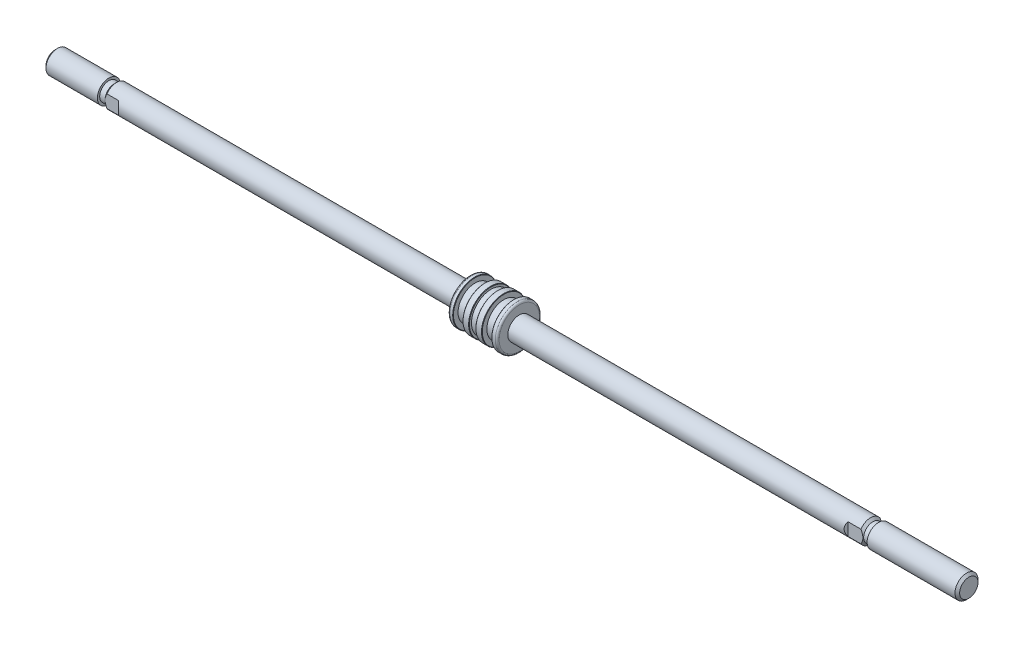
ISO-10303-21;
HEADER;
FILE_DESCRIPTION(('STEP AP214'),'2;1');
FILE_NAME('part.step','',(''),(''),'','','');
FILE_SCHEMA(('AUTOMOTIVE_DESIGN { 1 0 10303 214 1 1 1 1 }'));
ENDSEC;
DATA;
#1=APPLICATION_CONTEXT('core data for automotive mechanical design processes');
#2=APPLICATION_PROTOCOL_DEFINITION('international standard','automotive_design',2000,#1);
#3=PRODUCT_CONTEXT('',#1,'mechanical');
#4=PRODUCT('Part','Part','',(#3));
#5=PRODUCT_RELATED_PRODUCT_CATEGORY('part','',(#4));
#6=PRODUCT_DEFINITION_FORMATION('','',#4);
#7=PRODUCT_DEFINITION_CONTEXT('part definition',#1,'design');
#8=PRODUCT_DEFINITION('design','',#6,#7);
#9=PRODUCT_DEFINITION_SHAPE('','',#8);
#10=(LENGTH_UNIT() NAMED_UNIT(*) SI_UNIT(.MILLI.,.METRE.));
#11=(NAMED_UNIT(*) PLANE_ANGLE_UNIT() SI_UNIT($,.RADIAN.));
#12=(NAMED_UNIT(*) SI_UNIT($,.STERADIAN.) SOLID_ANGLE_UNIT());
#13=UNCERTAINTY_MEASURE_WITH_UNIT(LENGTH_MEASURE(1.E-05),#10,'distance_accuracy_value','');
#14=(GEOMETRIC_REPRESENTATION_CONTEXT(3) GLOBAL_UNCERTAINTY_ASSIGNED_CONTEXT((#13)) GLOBAL_UNIT_ASSIGNED_CONTEXT((#10,
#11,#12)) REPRESENTATION_CONTEXT('',''));
#15=CARTESIAN_POINT('',(0.,0.,0.));
#16=DIRECTION('',(0.,0.,1.));
#17=DIRECTION('',(1.,0.,0.));
#18=AXIS2_PLACEMENT_3D('',#15,#16,#17);
#19=CARTESIAN_POINT('',(-38.,0.,0.));
#20=DIRECTION('',(1.,0.,0.));
#21=DIRECTION('',(0.,0.,-1.));
#22=AXIS2_PLACEMENT_3D('',#19,#20,#21);
#23=PLANE('',#22);
#24=CARTESIAN_POINT('',(-38.0000000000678,0.,0.));
#25=DIRECTION('',(1.,0.,0.));
#26=DIRECTION('',(0.,0.,-1.));
#27=AXIS2_PLACEMENT_3D('',#24,#25,#26);
#28=CIRCLE('',#27,2.38650000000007);
#29=CARTESIAN_POINT('',(-38.0000000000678,0.,-2.38650000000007));
#30=VERTEX_POINT('',#29);
#31=EDGE_CURVE('E141',#30,#30,#28,.T.);
#32=ORIENTED_EDGE('',*,*,#31,.F.);
#33=EDGE_LOOP('',(#32));
#34=FACE_BOUND('',#33,.T.);
#35=ADVANCED_FACE('F17',(#34),#23,.F.);
#36=CARTESIAN_POINT('',(-37.3865000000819,0.,0.));
#37=DIRECTION('',(1.,0.,0.));
#38=DIRECTION('',(0.,0.,-1.));
#39=AXIS2_PLACEMENT_3D('',#36,#37,#38);
#40=CONICAL_SURFACE('',#39,2.9999999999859,0.785398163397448);
#41=CARTESIAN_POINT('',(-37.3865,0.,0.));
#42=DIRECTION('',(-1.,0.,0.));
#43=DIRECTION('',(0.,0.,1.));
#44=AXIS2_PLACEMENT_3D('',#41,#42,#43);
#45=CIRCLE('',#44,3.);
#46=CARTESIAN_POINT('',(-37.3865,0.,3.));
#47=VERTEX_POINT('',#46);
#48=EDGE_CURVE('E137',#47,#47,#45,.F.);
#49=ORIENTED_EDGE('',*,*,#48,.F.);
#50=EDGE_LOOP('',(#49));
#51=FACE_BOUND('',#50,.T.);
#52=ORIENTED_EDGE('',*,*,#31,.T.);
#53=EDGE_LOOP('',(#52));
#54=FACE_BOUND('',#53,.T.);
#55=ADVANCED_FACE('F334',(#51,#54),#40,.T.);
#56=CARTESIAN_POINT('',(82.9,0.,0.));
#57=DIRECTION('',(-1.,0.,0.));
#58=DIRECTION('',(0.,0.,1.));
#59=AXIS2_PLACEMENT_3D('',#56,#57,#58);
#60=CYLINDRICAL_SURFACE('',#59,3.);
#61=ORIENTED_EDGE('',*,*,#48,.T.);
#62=EDGE_LOOP('',(#61));
#63=FACE_BOUND('',#62,.T.);
#64=CARTESIAN_POINT('',(-24.,0.,0.));
#65=DIRECTION('',(-1.,0.,0.));
#66=DIRECTION('',(0.,0.,1.));
#67=AXIS2_PLACEMENT_3D('',#64,#65,#66);
#68=CIRCLE('',#67,3.);
#69=CARTESIAN_POINT('',(-24.,0.,3.));
#70=VERTEX_POINT('',#69);
#71=EDGE_CURVE('E140',#70,#70,#68,.T.);
#72=ORIENTED_EDGE('',*,*,#71,.T.);
#73=EDGE_LOOP('',(#72));
#74=FACE_BOUND('',#73,.T.);
#75=ADVANCED_FACE('F341',(#63,#74),#60,.T.);
#76=CARTESIAN_POINT('',(-24.,3.,0.));
#77=DIRECTION('',(-1.,0.,0.));
#78=DIRECTION('',(0.,0.,1.));
#79=AXIS2_PLACEMENT_3D('',#76,#77,#78);
#80=PLANE('',#79);
#81=CARTESIAN_POINT('',(-24.,0.,0.));
#82=DIRECTION('',(-1.,0.,0.));
#83=DIRECTION('',(0.,0.,1.));
#84=AXIS2_PLACEMENT_3D('',#81,#82,#83);
#85=CIRCLE('',#84,2.4);
#86=CARTESIAN_POINT('',(-24.,0.,2.4));
#87=VERTEX_POINT('',#86);
#88=EDGE_CURVE('E129',#87,#87,#85,.F.);
#89=ORIENTED_EDGE('',*,*,#88,.F.);
#90=EDGE_LOOP('',(#89));
#91=FACE_BOUND('',#90,.T.);
#92=ORIENTED_EDGE('',*,*,#71,.F.);
#93=EDGE_LOOP('',(#92));
#94=FACE_BOUND('',#93,.T.);
#95=ADVANCED_FACE('F470',(#91,#94),#80,.F.);
#96=CARTESIAN_POINT('',(82.9,0.,0.));
#97=DIRECTION('',(-1.,0.,0.));
#98=DIRECTION('',(0.,0.,1.));
#99=AXIS2_PLACEMENT_3D('',#96,#97,#98);
#100=CYLINDRICAL_SURFACE('',#99,2.4);
#101=ORIENTED_EDGE('',*,*,#88,.T.);
#102=EDGE_LOOP('',(#101));
#103=FACE_BOUND('',#102,.T.);
#104=CARTESIAN_POINT('',(-22.5999999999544,0.,0.));
#105=DIRECTION('',(1.,0.,0.));
#106=DIRECTION('',(0.,0.,-1.));
#107=AXIS2_PLACEMENT_3D('',#104,#105,#106);
#108=CIRCLE('',#107,2.40000000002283);
#109=CARTESIAN_POINT('',(-22.5999999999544,0.,-2.40000000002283));
#110=VERTEX_POINT('',#109);
#111=EDGE_CURVE('E98',#110,#110,#108,.T.);
#112=ORIENTED_EDGE('',*,*,#111,.F.);
#113=EDGE_LOOP('',(#112));
#114=FACE_BOUND('',#113,.T.);
#115=ADVANCED_FACE('F464',(#103,#114),#100,.T.);
#116=CARTESIAN_POINT('',(-22.46,-6.,-5.));
#117=DIRECTION('',(-1.,0.,0.));
#118=DIRECTION('',(0.,0.,1.));
#119=AXIS2_PLACEMENT_3D('',#116,#117,#118);
#120=PLANE('',#119);
#121=DIRECTION('',(0.,1.,0.));
#122=VECTOR('',#121,1.);
#123=CARTESIAN_POINT('',(-22.46,-6.,-2.5));
#124=LINE('',#123,#122);
#125=CARTESIAN_POINT('',(-22.4599999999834,0.448998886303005,-2.5));
#126=VERTEX_POINT('',#125);
#127=CARTESIAN_POINT('',(-22.4599999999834,-0.448998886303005,-2.5));
#128=VERTEX_POINT('',#127);
#129=EDGE_CURVE('E125',#126,#128,#124,.F.);
#130=ORIENTED_EDGE('',*,*,#129,.T.);
#131=CARTESIAN_POINT('',(-22.4599999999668,0.,0.));
#132=DIRECTION('',(1.,0.,0.));
#133=DIRECTION('',(0.,0.,-1.));
#134=AXIS2_PLACEMENT_3D('',#131,#132,#133);
#135=CIRCLE('',#134,2.53999999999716);
#136=EDGE_CURVE('E109',#126,#128,#135,.F.);
#137=ORIENTED_EDGE('',*,*,#136,.F.);
#138=EDGE_LOOP('',(#130,#137));
#139=FACE_BOUND('',#138,.T.);
#140=ADVANCED_FACE('F462',(#139),#120,.F.);
#141=CARTESIAN_POINT('',(-22.46,-6.,2.5));
#142=DIRECTION('',(-1.,0.,0.));
#143=DIRECTION('',(0.,0.,1.));
#144=AXIS2_PLACEMENT_3D('',#141,#142,#143);
#145=PLANE('',#144);
#146=CARTESIAN_POINT('',(-22.4599999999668,0.,0.));
#147=DIRECTION('',(1.,0.,0.));
#148=DIRECTION('',(0.,0.,-1.));
#149=AXIS2_PLACEMENT_3D('',#146,#147,#148);
#150=CIRCLE('',#149,2.53999999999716);
#151=CARTESIAN_POINT('',(-22.4599999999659,-0.448998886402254,2.5));
#152=VERTEX_POINT('',#151);
#153=CARTESIAN_POINT('',(-22.4599999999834,0.448998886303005,2.5));
#154=VERTEX_POINT('',#153);
#155=EDGE_CURVE('E90',#152,#154,#150,.F.);
#156=ORIENTED_EDGE('',*,*,#155,.F.);
#157=DIRECTION('',(0.,1.,0.));
#158=VECTOR('',#157,1.);
#159=CARTESIAN_POINT('',(-22.46,-6.,2.5));
#160=LINE('',#159,#158);
#161=EDGE_CURVE('E94',#152,#154,#160,.T.);
#162=ORIENTED_EDGE('',*,*,#161,.T.);
#163=EDGE_LOOP('',(#156,#162));
#164=FACE_BOUND('',#163,.T.);
#165=ADVANCED_FACE('F92',(#164),#145,.F.);
#166=CARTESIAN_POINT('',(-19.,-6.,-2.5));
#167=DIRECTION('',(0.70710678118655,0.,0.707106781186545));
#168=DIRECTION('',(0.707106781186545,0.,-0.70710678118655));
#169=AXIS2_PLACEMENT_3D('',#166,#167,#168);
#170=PLANE('',#169);
#171=CARTESIAN_POINT('',(-21.5,0.,0.));
#172=DIRECTION('',(0.70710678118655,0.,0.707106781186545));
#173=DIRECTION('',(-0.707106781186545,0.,0.70710678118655));
#174=AXIS2_PLACEMENT_3D('',#171,#172,#173);
#175=ELLIPSE('',#174,4.24264068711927,3.);
#176=CARTESIAN_POINT('',(-19.,-1.6583123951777,-2.5));
#177=VERTEX_POINT('',#176);
#178=CARTESIAN_POINT('',(-19.,1.6583123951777,-2.5));
#179=VERTEX_POINT('',#178);
#180=EDGE_CURVE('E437',#177,#179,#175,.T.);
#181=ORIENTED_EDGE('',*,*,#180,.F.);
#182=DIRECTION('',(0.,1.,0.));
#183=VECTOR('',#182,1.);
#184=CARTESIAN_POINT('',(-19.,-6.,-2.5));
#185=LINE('',#184,#183);
#186=EDGE_CURVE('E130',#177,#179,#185,.T.);
#187=ORIENTED_EDGE('',*,*,#186,.T.);
#188=EDGE_LOOP('',(#181,#187));
#189=FACE_BOUND('',#188,.T.);
#190=ADVANCED_FACE('F320',(#189),#170,.F.);
#191=CARTESIAN_POINT('',(-22.46,-6.,-2.5));
#192=DIRECTION('',(0.,0.,1.));
#193=DIRECTION('',(1.,0.,0.));
#194=AXIS2_PLACEMENT_3D('',#191,#192,#193);
#195=PLANE('',#194);
#196=ORIENTED_EDGE('',*,*,#186,.F.);
#197=DIRECTION('',(-1.,0.,0.));
#198=VECTOR('',#197,1.);
#199=CARTESIAN_POINT('',(82.9,-1.6583123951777,-2.5));
#200=LINE('',#199,#198);
#201=CARTESIAN_POINT('',(-21.9999999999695,-1.65831239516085,-2.5));
#202=VERTEX_POINT('',#201);
#203=EDGE_CURVE('E133',#202,#177,#200,.F.);
#204=ORIENTED_EDGE('',*,*,#203,.F.);
#205=CARTESIAN_POINT('',(-22.4599999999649,-0.448998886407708,-2.5));
#206=CARTESIAN_POINT('',(-22.4436019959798,-0.541923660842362,-2.5));
#207=CARTESIAN_POINT('',(-22.422379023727,-0.633854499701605,-2.5));
#208=CARTESIAN_POINT('',(-22.3718615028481,-0.815259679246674,-2.5));
#209=CARTESIAN_POINT('',(-22.3425860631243,-0.904739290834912,-2.5));
#210=CARTESIAN_POINT('',(-22.2777433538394,-1.08041958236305,-2.5));
#211=CARTESIAN_POINT('',(-22.2422350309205,-1.16664251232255,-2.5));
#212=CARTESIAN_POINT('',(-22.1660562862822,-1.3367963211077,-2.5));
#213=CARTESIAN_POINT('',(-22.1253841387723,-1.42072642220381,-2.5));
#214=CARTESIAN_POINT('',(-22.0692905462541,-1.52955928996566,-2.5));
#215=CARTESIAN_POINT('',(-22.0557042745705,-1.55542639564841,-2.5));
#216=CARTESIAN_POINT('',(-22.0281373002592,-1.60699838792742,-2.5));
#217=CARTESIAN_POINT('',(-22.0141560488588,-1.6327029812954,-2.5));
#218=CARTESIAN_POINT('',(-21.9999999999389,-1.65831239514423,-2.5));
#219=B_SPLINE_CURVE_WITH_KNOTS('',3,(#205,#206,#207,#208,#209,#210,#211,#212,#213,#214,#215,
#216,#217,#218),.UNSPECIFIED.,.F.,.F.,(4,2,2,2,2,2,4),(0.,0.282752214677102,0.564839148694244,
0.844389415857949,1.12403335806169,1.21168601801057,1.29946711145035),.UNSPECIFIED.);
#220=EDGE_CURVE('E128',#128,#202,#219,.T.);
#221=ORIENTED_EDGE('',*,*,#220,.F.);
#222=ORIENTED_EDGE('',*,*,#129,.F.);
#223=CARTESIAN_POINT('',(-21.9999999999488,1.65831239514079,-2.50000000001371));
#224=CARTESIAN_POINT('',(-22.0262525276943,1.6108142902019,-2.50000000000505));
#225=CARTESIAN_POINT('',(-22.0519105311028,1.56298651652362,-2.50000000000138));
#226=CARTESIAN_POINT('',(-22.1018578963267,1.46660480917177,-2.49999999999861));
#227=CARTESIAN_POINT('',(-22.1261468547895,1.4180506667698,-2.49999999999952));
#228=CARTESIAN_POINT('',(-22.1963411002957,1.27192090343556,-2.50000000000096));
#229=CARTESIAN_POINT('',(-22.2399439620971,1.17321868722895,-2.50000000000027));
#230=CARTESIAN_POINT('',(-22.3191456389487,0.972359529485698,-2.49999999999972));
#231=CARTESIAN_POINT('',(-22.3547293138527,0.870196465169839,-2.49999999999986));
#232=CARTESIAN_POINT('',(-22.4157271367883,0.662163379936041,-2.50000000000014));
#233=CARTESIAN_POINT('',(-22.4410708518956,0.556272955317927,-2.50000000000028));
#234=CARTESIAN_POINT('',(-22.459999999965,0.448998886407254,-2.5));
#235=B_SPLINE_CURVE_WITH_KNOTS('',3,(#223,#224,#225,#226,#227,#228,#229,#230,#231,#232,#233,
#234),.UNSPECIFIED.,.F.,.F.,(4,2,2,2,2,4),(0.,0.162805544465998,0.325658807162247,
0.64910085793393,0.973148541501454,1.29938863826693),.UNSPECIFIED.);
#236=CARTESIAN_POINT('',(-21.9999999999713,1.65831239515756,-2.5));
#237=VERTEX_POINT('',#236);
#238=EDGE_CURVE('E97',#237,#126,#235,.T.);
#239=ORIENTED_EDGE('',*,*,#238,.F.);
#240=DIRECTION('',(-1.,0.,0.));
#241=VECTOR('',#240,1.);
#242=CARTESIAN_POINT('',(82.9,1.6583123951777,-2.5));
#243=LINE('',#242,#241);
#244=EDGE_CURVE('E124',#179,#237,#243,.T.);
#245=ORIENTED_EDGE('',*,*,#244,.F.);
#246=EDGE_LOOP('',(#196,#204,#221,#222,#239,#245));
#247=FACE_BOUND('',#246,.T.);
#248=ADVANCED_FACE('F316',(#247),#195,.F.);
#249=CARTESIAN_POINT('',(-21.9999999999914,0.,0.));
#250=DIRECTION('',(1.,0.,0.));
#251=DIRECTION('',(0.,0.,-1.));
#252=AXIS2_PLACEMENT_3D('',#249,#250,#251);
#253=CONICAL_SURFACE('',#252,2.99999999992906,0.785398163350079);
#254=CARTESIAN_POINT('',(-21.9999999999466,-1.65831239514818,2.50000000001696));
#255=CARTESIAN_POINT('',(-22.0262525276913,-1.61081429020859,2.50000000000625));
#256=CARTESIAN_POINT('',(-22.0519105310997,-1.56298651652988,2.50000000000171));
#257=CARTESIAN_POINT('',(-22.1018578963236,-1.46660480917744,2.49999999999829));
#258=CARTESIAN_POINT('',(-22.1261468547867,-1.41805066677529,2.4999999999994));
#259=CARTESIAN_POINT('',(-22.1963411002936,-1.27192090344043,2.50000000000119));
#260=CARTESIAN_POINT('',(-22.2399439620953,-1.17321868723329,2.50000000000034));
#261=CARTESIAN_POINT('',(-22.3191456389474,-0.972359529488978,2.49999999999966));
#262=CARTESIAN_POINT('',(-22.3547293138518,-0.870196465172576,2.49999999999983));
#263=CARTESIAN_POINT('',(-22.415727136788,-0.662163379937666,2.50000000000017));
#264=CARTESIAN_POINT('',(-22.4410708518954,-0.556272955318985,2.50000000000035));
#265=CARTESIAN_POINT('',(-22.4599999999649,-0.448998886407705,2.5));
#266=B_SPLINE_CURVE_WITH_KNOTS('',3,(#254,#255,#256,#257,#258,#259,#260,#261,#262,#263,#264,
#265),.UNSPECIFIED.,.F.,.F.,(4,2,2,2,2,4),(0.,0.162805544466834,0.325658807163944,
0.649100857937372,0.973148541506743,1.29938863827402),.UNSPECIFIED.);
#267=CARTESIAN_POINT('',(-21.9999999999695,-1.65831239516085,2.5));
#268=VERTEX_POINT('',#267);
#269=EDGE_CURVE('E101',#268,#152,#266,.T.);
#270=ORIENTED_EDGE('',*,*,#269,.T.);
#271=ORIENTED_EDGE('',*,*,#155,.T.);
#272=CARTESIAN_POINT('',(-22.4599999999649,0.448998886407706,2.5));
#273=CARTESIAN_POINT('',(-22.4436019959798,0.541923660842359,2.5));
#274=CARTESIAN_POINT('',(-22.422379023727,0.633854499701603,2.5));
#275=CARTESIAN_POINT('',(-22.3718615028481,0.815259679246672,2.5));
#276=CARTESIAN_POINT('',(-22.3425860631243,0.904739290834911,2.5));
#277=CARTESIAN_POINT('',(-22.2777433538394,1.08041958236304,2.5));
#278=CARTESIAN_POINT('',(-22.2422350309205,1.16664251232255,2.5));
#279=CARTESIAN_POINT('',(-22.1660562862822,1.3367963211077,2.5));
#280=CARTESIAN_POINT('',(-22.1253841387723,1.42072642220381,2.5));
#281=CARTESIAN_POINT('',(-22.0692905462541,1.52955928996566,2.5));
#282=CARTESIAN_POINT('',(-22.0557042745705,1.55542639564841,2.5));
#283=CARTESIAN_POINT('',(-22.0281373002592,1.60699838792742,2.5));
#284=CARTESIAN_POINT('',(-22.0141560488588,1.6327029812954,2.5));
#285=CARTESIAN_POINT('',(-21.9999999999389,1.65831239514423,2.5));
#286=B_SPLINE_CURVE_WITH_KNOTS('',3,(#272,#273,#274,#275,#276,#277,#278,#279,#280,#281,#282,
#283,#284,#285),.UNSPECIFIED.,.F.,.F.,(4,2,2,2,2,2,4),(0.,0.282752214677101,0.564839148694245,
0.844389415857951,1.12403335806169,1.21168601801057,1.29946711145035),.UNSPECIFIED.);
#287=CARTESIAN_POINT('',(-21.9999999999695,1.65831239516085,2.5));
#288=VERTEX_POINT('',#287);
#289=EDGE_CURVE('E113',#154,#288,#286,.T.);
#290=ORIENTED_EDGE('',*,*,#289,.T.);
#291=CARTESIAN_POINT('',(-22.,0.,0.));
#292=DIRECTION('',(-1.,0.,0.));
#293=DIRECTION('',(0.,0.,1.));
#294=AXIS2_PLACEMENT_3D('',#291,#292,#293);
#295=CIRCLE('',#294,3.);
#296=EDGE_CURVE('E120',#237,#288,#295,.F.);
#297=ORIENTED_EDGE('',*,*,#296,.F.);
#298=ORIENTED_EDGE('',*,*,#238,.T.);
#299=ORIENTED_EDGE('',*,*,#136,.T.);
#300=ORIENTED_EDGE('',*,*,#220,.T.);
#301=CARTESIAN_POINT('',(-22.,0.,0.));
#302=DIRECTION('',(-1.,0.,0.));
#303=DIRECTION('',(0.,0.,1.));
#304=AXIS2_PLACEMENT_3D('',#301,#302,#303);
#305=CIRCLE('',#304,3.);
#306=EDGE_CURVE('E105',#268,#202,#305,.F.);
#307=ORIENTED_EDGE('',*,*,#306,.F.);
#308=EDGE_LOOP('',(#270,#271,#290,#297,#298,#299,#300,#307));
#309=FACE_BOUND('',#308,.T.);
#310=ORIENTED_EDGE('',*,*,#111,.T.);
#311=EDGE_LOOP('',(#310));
#312=FACE_BOUND('',#311,.T.);
#313=ADVANCED_FACE('F102',(#309,#312),#253,.T.);
#314=CARTESIAN_POINT('',(-19.,-6.,2.5));
#315=DIRECTION('',(0.,0.,-1.));
#316=DIRECTION('',(-1.,0.,0.));
#317=AXIS2_PLACEMENT_3D('',#314,#315,#316);
#318=PLANE('',#317);
#319=DIRECTION('',(0.,1.,0.));
#320=VECTOR('',#319,1.);
#321=CARTESIAN_POINT('',(-19.,-6.,2.5));
#322=LINE('',#321,#320);
#323=CARTESIAN_POINT('',(-19.,-1.6583123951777,2.5));
#324=VERTEX_POINT('',#323);
#325=CARTESIAN_POINT('',(-19.,1.6583123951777,2.5));
#326=VERTEX_POINT('',#325);
#327=EDGE_CURVE('E115',#324,#326,#322,.T.);
#328=ORIENTED_EDGE('',*,*,#327,.T.);
#329=DIRECTION('',(-1.,0.,0.));
#330=VECTOR('',#329,1.);
#331=CARTESIAN_POINT('',(82.9,1.6583123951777,2.5));
#332=LINE('',#331,#330);
#333=EDGE_CURVE('E123',#288,#326,#332,.F.);
#334=ORIENTED_EDGE('',*,*,#333,.F.);
#335=ORIENTED_EDGE('',*,*,#289,.F.);
#336=ORIENTED_EDGE('',*,*,#161,.F.);
#337=ORIENTED_EDGE('',*,*,#269,.F.);
#338=DIRECTION('',(-1.,0.,0.));
#339=VECTOR('',#338,1.);
#340=CARTESIAN_POINT('',(82.9,-1.6583123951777,2.5));
#341=LINE('',#340,#339);
#342=EDGE_CURVE('E134',#324,#268,#341,.T.);
#343=ORIENTED_EDGE('',*,*,#342,.F.);
#344=EDGE_LOOP('',(#328,#334,#335,#336,#337,#343));
#345=FACE_BOUND('',#344,.T.);
#346=ADVANCED_FACE('F111',(#345),#318,.F.);
#347=CARTESIAN_POINT('',(-16.5,-6.,5.));
#348=DIRECTION('',(0.707106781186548,0.,-0.707106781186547));
#349=DIRECTION('',(-0.707106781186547,0.,-0.707106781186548));
#350=AXIS2_PLACEMENT_3D('',#347,#348,#349);
#351=PLANE('',#350);
#352=ORIENTED_EDGE('',*,*,#327,.F.);
#353=CARTESIAN_POINT('',(-21.5,0.,0.));
#354=DIRECTION('',(0.707106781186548,0.,-0.707106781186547));
#355=DIRECTION('',(-0.707106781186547,0.,-0.707106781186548));
#356=AXIS2_PLACEMENT_3D('',#353,#354,#355);
#357=ELLIPSE('',#356,4.24264068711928,3.);
#358=EDGE_CURVE('E436',#326,#324,#357,.T.);
#359=ORIENTED_EDGE('',*,*,#358,.F.);
#360=EDGE_LOOP('',(#352,#359));
#361=FACE_BOUND('',#360,.T.);
#362=ADVANCED_FACE('F290',(#361),#351,.F.);
#363=CARTESIAN_POINT('',(82.9,0.,0.));
#364=DIRECTION('',(-1.,0.,0.));
#365=DIRECTION('',(0.,0.,1.));
#366=AXIS2_PLACEMENT_3D('',#363,#364,#365);
#367=CYLINDRICAL_SURFACE('',#366,3.);
#368=ORIENTED_EDGE('',*,*,#203,.T.);
#369=ORIENTED_EDGE('',*,*,#180,.T.);
#370=ORIENTED_EDGE('',*,*,#244,.T.);
#371=ORIENTED_EDGE('',*,*,#296,.T.);
#372=ORIENTED_EDGE('',*,*,#333,.T.);
#373=ORIENTED_EDGE('',*,*,#358,.T.);
#374=ORIENTED_EDGE('',*,*,#342,.T.);
#375=ORIENTED_EDGE('',*,*,#306,.T.);
#376=EDGE_LOOP('',(#368,#369,#370,#371,#372,#373,#374,#375));
#377=FACE_BOUND('',#376,.T.);
#378=CARTESIAN_POINT('',(68.6,0.,0.));
#379=DIRECTION('',(-1.,0.,0.));
#380=DIRECTION('',(0.,0.,1.));
#381=AXIS2_PLACEMENT_3D('',#378,#379,#380);
#382=CIRCLE('',#381,3.);
#383=CARTESIAN_POINT('',(68.6,0.,3.));
#384=VERTEX_POINT('',#383);
#385=EDGE_CURVE('E433',#384,#384,#382,.T.);
#386=ORIENTED_EDGE('',*,*,#385,.T.);
#387=EDGE_LOOP('',(#386));
#388=FACE_BOUND('',#387,.T.);
#389=ADVANCED_FACE('F286',(#377,#388),#367,.T.);
#390=CARTESIAN_POINT('',(68.6,3.,0.));
#391=DIRECTION('',(-1.,0.,0.));
#392=DIRECTION('',(0.,0.,1.));
#393=AXIS2_PLACEMENT_3D('',#390,#391,#392);
#394=PLANE('',#393);
#395=CARTESIAN_POINT('',(68.6,0.,0.));
#396=DIRECTION('',(-1.,0.,0.));
#397=DIRECTION('',(0.,0.,1.));
#398=AXIS2_PLACEMENT_3D('',#395,#396,#397);
#399=CIRCLE('',#398,2.95);
#400=CARTESIAN_POINT('',(68.6,0.,2.95));
#401=VERTEX_POINT('',#400);
#402=EDGE_CURVE('E430',#401,#401,#399,.F.);
#403=ORIENTED_EDGE('',*,*,#402,.F.);
#404=EDGE_LOOP('',(#403));
#405=FACE_BOUND('',#404,.T.);
#406=ORIENTED_EDGE('',*,*,#385,.F.);
#407=EDGE_LOOP('',(#406));
#408=FACE_BOUND('',#407,.T.);
#409=ADVANCED_FACE('F282',(#405,#408),#394,.F.);
#410=CARTESIAN_POINT('',(82.9,0.,0.));
#411=DIRECTION('',(-1.,0.,0.));
#412=DIRECTION('',(0.,0.,1.));
#413=AXIS2_PLACEMENT_3D('',#410,#411,#412);
#414=CYLINDRICAL_SURFACE('',#413,2.95);
#415=ORIENTED_EDGE('',*,*,#402,.T.);
#416=EDGE_LOOP('',(#415));
#417=FACE_BOUND('',#416,.T.);
#418=CARTESIAN_POINT('',(70.1,0.,0.));
#419=DIRECTION('',(-1.,0.,0.));
#420=DIRECTION('',(0.,0.,1.));
#421=AXIS2_PLACEMENT_3D('',#418,#419,#420);
#422=CIRCLE('',#421,2.95);
#423=CARTESIAN_POINT('',(70.1,0.,2.95));
#424=VERTEX_POINT('',#423);
#425=EDGE_CURVE('E254',#424,#424,#422,.T.);
#426=ORIENTED_EDGE('',*,*,#425,.T.);
#427=EDGE_LOOP('',(#426));
#428=FACE_BOUND('',#427,.T.);
#429=ADVANCED_FACE('F275',(#417,#428),#414,.T.);
#430=CARTESIAN_POINT('',(70.1,2.95,0.));
#431=DIRECTION('',(1.,0.,0.));
#432=DIRECTION('',(0.,0.,-1.));
#433=AXIS2_PLACEMENT_3D('',#430,#431,#432);
#434=PLANE('',#433);
#435=CARTESIAN_POINT('',(70.1,0.,0.));
#436=DIRECTION('',(1.,0.,0.));
#437=DIRECTION('',(0.,0.,1.));
#438=AXIS2_PLACEMENT_3D('',#435,#436,#437);
#439=CIRCLE('',#438,5.25);
#440=CARTESIAN_POINT('',(70.1,0.,5.25));
#441=VERTEX_POINT('',#440);
#442=CARTESIAN_POINT('',(70.1,0.,-5.25));
#443=VERTEX_POINT('',#442);
#444=EDGE_CURVE('E244',#441,#443,#439,.T.);
#445=ORIENTED_EDGE('',*,*,#444,.F.);
#446=CARTESIAN_POINT('',(70.1,0.,0.));
#447=DIRECTION('',(1.,0.,0.));
#448=DIRECTION('',(0.,0.,-1.));
#449=AXIS2_PLACEMENT_3D('',#446,#447,#448);
#450=CIRCLE('',#449,5.25);
#451=EDGE_CURVE('E249',#443,#441,#450,.T.);
#452=ORIENTED_EDGE('',*,*,#451,.F.);
#453=EDGE_LOOP('',(#445,#452));
#454=FACE_BOUND('',#453,.T.);
#455=ORIENTED_EDGE('',*,*,#425,.F.);
#456=EDGE_LOOP('',(#455));
#457=FACE_BOUND('',#456,.T.);
#458=ADVANCED_FACE('F256',(#454,#457),#434,.F.);
#459=CARTESIAN_POINT('',(70.6,0.,0.));
#460=DIRECTION('',(-1.,0.,0.));
#461=DIRECTION('',(0.,0.,1.));
#462=AXIS2_PLACEMENT_3D('',#459,#460,#461);
#463=TOROIDAL_SURFACE('',#462,5.25,0.500000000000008);
#464=ORIENTED_EDGE('',*,*,#444,.T.);
#465=ORIENTED_EDGE('',*,*,#451,.T.);
#466=EDGE_LOOP('',(#464,#465));
#467=FACE_BOUND('',#466,.T.);
#468=CARTESIAN_POINT('',(70.6,0.,0.));
#469=DIRECTION('',(-1.,0.,0.));
#470=DIRECTION('',(0.,0.,1.));
#471=AXIS2_PLACEMENT_3D('',#468,#469,#470);
#472=CIRCLE('',#471,5.75);
#473=CARTESIAN_POINT('',(70.6,0.,5.75));
#474=VERTEX_POINT('',#473);
#475=EDGE_CURVE('E258',#474,#474,#472,.F.);
#476=ORIENTED_EDGE('',*,*,#475,.F.);
#477=EDGE_LOOP('',(#476));
#478=FACE_BOUND('',#477,.T.);
#479=ADVANCED_FACE('F246',(#467,#478),#463,.T.);
#480=CARTESIAN_POINT('',(82.9,0.,0.));
#481=DIRECTION('',(-1.,0.,0.));
#482=DIRECTION('',(0.,0.,1.));
#483=AXIS2_PLACEMENT_3D('',#480,#481,#482);
#484=CYLINDRICAL_SURFACE('',#483,5.75);
#485=ORIENTED_EDGE('',*,*,#475,.T.);
#486=EDGE_LOOP('',(#485));
#487=FACE_BOUND('',#486,.T.);
#488=CARTESIAN_POINT('',(71.2999999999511,0.,0.));
#489=DIRECTION('',(-1.,0.,0.));
#490=DIRECTION('',(0.,0.,1.));
#491=AXIS2_PLACEMENT_3D('',#488,#489,#490);
#492=CIRCLE('',#491,5.75000000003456);
#493=CARTESIAN_POINT('',(71.2999999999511,0.,5.75000000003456));
#494=VERTEX_POINT('',#493);
#495=EDGE_CURVE('E427',#494,#494,#492,.F.);
#496=ORIENTED_EDGE('',*,*,#495,.F.);
#497=EDGE_LOOP('',(#496));
#498=FACE_BOUND('',#497,.T.);
#499=ADVANCED_FACE('F578',(#487,#498),#484,.T.);
#500=CARTESIAN_POINT('',(71.3000000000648,0.,0.));
#501=DIRECTION('',(-1.,0.,0.));
#502=DIRECTION('',(0.,0.,1.));
#503=AXIS2_PLACEMENT_3D('',#500,#501,#502);
#504=CONICAL_SURFACE('',#503,5.74999999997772,0.785398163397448);
#505=ORIENTED_EDGE('',*,*,#495,.T.);
#506=EDGE_LOOP('',(#505));
#507=FACE_BOUND('',#506,.T.);
#508=CARTESIAN_POINT('',(71.3999999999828,0.,0.));
#509=DIRECTION('',(-1.,0.,0.));
#510=DIRECTION('',(0.,0.,1.));
#511=AXIS2_PLACEMENT_3D('',#508,#509,#510);
#512=CIRCLE('',#511,5.65000000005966);
#513=CARTESIAN_POINT('',(71.3999999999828,0.,5.65000000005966));
#514=VERTEX_POINT('',#513);
#515=EDGE_CURVE('E424',#514,#514,#512,.T.);
#516=ORIENTED_EDGE('',*,*,#515,.T.);
#517=EDGE_LOOP('',(#516));
#518=FACE_BOUND('',#517,.T.);
#519=ADVANCED_FACE('F586',(#507,#518),#504,.T.);
#520=CARTESIAN_POINT('',(71.4,5.65,0.));
#521=DIRECTION('',(-1.,0.,0.));
#522=DIRECTION('',(0.,0.,1.));
#523=AXIS2_PLACEMENT_3D('',#520,#521,#522);
#524=PLANE('',#523);
#525=CARTESIAN_POINT('',(71.4,0.,0.));
#526=DIRECTION('',(-1.,0.,0.));
#527=DIRECTION('',(0.,0.,1.));
#528=AXIS2_PLACEMENT_3D('',#525,#526,#527);
#529=CIRCLE('',#528,4.45);
#530=CARTESIAN_POINT('',(71.4,0.,4.45));
#531=VERTEX_POINT('',#530);
#532=EDGE_CURVE('E421',#531,#531,#529,.F.);
#533=ORIENTED_EDGE('',*,*,#532,.F.);
#534=EDGE_LOOP('',(#533));
#535=FACE_BOUND('',#534,.T.);
#536=ORIENTED_EDGE('',*,*,#515,.F.);
#537=EDGE_LOOP('',(#536));
#538=FACE_BOUND('',#537,.T.);
#539=ADVANCED_FACE('F595',(#535,#538),#524,.F.);
#540=CARTESIAN_POINT('',(82.9,0.,0.));
#541=DIRECTION('',(-1.,0.,0.));
#542=DIRECTION('',(0.,0.,1.));
#543=AXIS2_PLACEMENT_3D('',#540,#541,#542);
#544=CYLINDRICAL_SURFACE('',#543,4.45);
#545=ORIENTED_EDGE('',*,*,#532,.T.);
#546=EDGE_LOOP('',(#545));
#547=FACE_BOUND('',#546,.T.);
#548=CARTESIAN_POINT('',(73.9,0.,0.));
#549=DIRECTION('',(-1.,0.,0.));
#550=DIRECTION('',(0.,0.,1.));
#551=AXIS2_PLACEMENT_3D('',#548,#549,#550);
#552=CIRCLE('',#551,4.45);
#553=CARTESIAN_POINT('',(73.9,0.,4.45));
#554=VERTEX_POINT('',#553);
#555=EDGE_CURVE('E418',#554,#554,#552,.T.);
#556=ORIENTED_EDGE('',*,*,#555,.T.);
#557=EDGE_LOOP('',(#556));
#558=FACE_BOUND('',#557,.T.);
#559=ADVANCED_FACE('F605',(#547,#558),#544,.T.);
#560=CARTESIAN_POINT('',(73.9,4.45,0.));
#561=DIRECTION('',(1.,0.,0.));
#562=DIRECTION('',(0.,0.,-1.));
#563=AXIS2_PLACEMENT_3D('',#560,#561,#562);
#564=PLANE('',#563);
#565=CARTESIAN_POINT('',(73.8999999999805,0.,0.));
#566=DIRECTION('',(1.,0.,0.));
#567=DIRECTION('',(0.,0.,-1.));
#568=AXIS2_PLACEMENT_3D('',#565,#566,#567);
#569=CIRCLE('',#568,5.64999999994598);
#570=CARTESIAN_POINT('',(73.8999999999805,0.,-5.64999999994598));
#571=VERTEX_POINT('',#570);
#572=EDGE_CURVE('E414',#571,#571,#569,.T.);
#573=ORIENTED_EDGE('',*,*,#572,.F.);
#574=EDGE_LOOP('',(#573));
#575=FACE_BOUND('',#574,.T.);
#576=ORIENTED_EDGE('',*,*,#555,.F.);
#577=EDGE_LOOP('',(#576));
#578=FACE_BOUND('',#577,.T.);
#579=ADVANCED_FACE('F615',(#575,#578),#564,.F.);
#580=CARTESIAN_POINT('',(74.0000000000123,0.,0.));
#581=DIRECTION('',(1.,0.,0.));
#582=DIRECTION('',(0.,0.,-1.));
#583=AXIS2_PLACEMENT_3D('',#580,#581,#582);
#584=CONICAL_SURFACE('',#583,5.74999999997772,0.785398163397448);
#585=CARTESIAN_POINT('',(74.,0.,0.));
#586=DIRECTION('',(-1.,0.,0.));
#587=DIRECTION('',(0.,0.,1.));
#588=AXIS2_PLACEMENT_3D('',#585,#586,#587);
#589=CIRCLE('',#588,5.75);
#590=CARTESIAN_POINT('',(74.,0.,5.75));
#591=VERTEX_POINT('',#590);
#592=EDGE_CURVE('E417',#591,#591,#589,.F.);
#593=ORIENTED_EDGE('',*,*,#592,.F.);
#594=EDGE_LOOP('',(#593));
#595=FACE_BOUND('',#594,.T.);
#596=ORIENTED_EDGE('',*,*,#572,.T.);
#597=EDGE_LOOP('',(#596));
#598=FACE_BOUND('',#597,.T.);
#599=ADVANCED_FACE('F625',(#595,#598),#584,.T.);
#600=CARTESIAN_POINT('',(82.9,0.,0.));
#601=DIRECTION('',(-1.,0.,0.));
#602=DIRECTION('',(0.,0.,1.));
#603=AXIS2_PLACEMENT_3D('',#600,#601,#602);
#604=CYLINDRICAL_SURFACE('',#603,5.75);
#605=ORIENTED_EDGE('',*,*,#592,.T.);
#606=EDGE_LOOP('',(#605));
#607=FACE_BOUND('',#606,.T.);
#608=CARTESIAN_POINT('',(75.4499999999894,0.,0.));
#609=DIRECTION('',(-1.,0.,0.));
#610=DIRECTION('',(0.,0.,1.));
#611=AXIS2_PLACEMENT_3D('',#608,#609,#610);
#612=CIRCLE('',#611,5.75000000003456);
#613=CARTESIAN_POINT('',(75.4499999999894,0.,5.75000000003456));
#614=VERTEX_POINT('',#613);
#615=EDGE_CURVE('E413',#614,#614,#612,.F.);
#616=ORIENTED_EDGE('',*,*,#615,.F.);
#617=EDGE_LOOP('',(#616));
#618=FACE_BOUND('',#617,.T.);
#619=ADVANCED_FACE('F635',(#607,#618),#604,.T.);
#620=CARTESIAN_POINT('',(75.4499999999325,0.,0.));
#621=DIRECTION('',(-1.,0.,0.));
#622=DIRECTION('',(0.,0.,1.));
#623=AXIS2_PLACEMENT_3D('',#620,#621,#622);
#624=CONICAL_SURFACE('',#623,5.7500000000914,0.785398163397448);
#625=ORIENTED_EDGE('',*,*,#615,.T.);
#626=EDGE_LOOP('',(#625));
#627=FACE_BOUND('',#626,.T.);
#628=CARTESIAN_POINT('',(75.5500000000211,0.,0.));
#629=DIRECTION('',(-1.,0.,0.));
#630=DIRECTION('',(0.,0.,1.));
#631=AXIS2_PLACEMENT_3D('',#628,#629,#630);
#632=CIRCLE('',#631,5.65000000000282);
#633=CARTESIAN_POINT('',(75.5500000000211,0.,5.65000000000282));
#634=VERTEX_POINT('',#633);
#635=EDGE_CURVE('E410',#634,#634,#632,.T.);
#636=ORIENTED_EDGE('',*,*,#635,.T.);
#637=EDGE_LOOP('',(#636));
#638=FACE_BOUND('',#637,.T.);
#639=ADVANCED_FACE('F645',(#627,#638),#624,.T.);
#640=CARTESIAN_POINT('',(75.55,5.65,0.));
#641=DIRECTION('',(-1.,0.,0.));
#642=DIRECTION('',(0.,0.,1.));
#643=AXIS2_PLACEMENT_3D('',#640,#641,#642);
#644=PLANE('',#643);
#645=CARTESIAN_POINT('',(75.55,0.,0.));
#646=DIRECTION('',(-1.,0.,0.));
#647=DIRECTION('',(0.,0.,1.));
#648=AXIS2_PLACEMENT_3D('',#645,#646,#647);
#649=CIRCLE('',#648,5.1);
#650=CARTESIAN_POINT('',(75.55,0.,5.1));
#651=VERTEX_POINT('',#650);
#652=EDGE_CURVE('E407',#651,#651,#649,.F.);
#653=ORIENTED_EDGE('',*,*,#652,.F.);
#654=EDGE_LOOP('',(#653));
#655=FACE_BOUND('',#654,.T.);
#656=ORIENTED_EDGE('',*,*,#635,.F.);
#657=EDGE_LOOP('',(#656));
#658=FACE_BOUND('',#657,.T.);
#659=ADVANCED_FACE('F655',(#655,#658),#644,.F.);
#660=CARTESIAN_POINT('',(82.9,0.,0.));
#661=DIRECTION('',(-1.,0.,0.));
#662=DIRECTION('',(0.,0.,1.));
#663=AXIS2_PLACEMENT_3D('',#660,#661,#662);
#664=CYLINDRICAL_SURFACE('',#663,5.1);
#665=ORIENTED_EDGE('',*,*,#652,.T.);
#666=EDGE_LOOP('',(#665));
#667=FACE_BOUND('',#666,.T.);
#668=CARTESIAN_POINT('',(77.25,0.,0.));
#669=DIRECTION('',(-1.,0.,0.));
#670=DIRECTION('',(0.,0.,1.));
#671=AXIS2_PLACEMENT_3D('',#668,#669,#670);
#672=CIRCLE('',#671,5.1);
#673=CARTESIAN_POINT('',(77.25,0.,5.1));
#674=VERTEX_POINT('',#673);
#675=EDGE_CURVE('E404',#674,#674,#672,.T.);
#676=ORIENTED_EDGE('',*,*,#675,.T.);
#677=EDGE_LOOP('',(#676));
#678=FACE_BOUND('',#677,.T.);
#679=ADVANCED_FACE('F665',(#667,#678),#664,.T.);
#680=CARTESIAN_POINT('',(77.25,5.1,0.));
#681=DIRECTION('',(1.,0.,0.));
#682=DIRECTION('',(0.,0.,-1.));
#683=AXIS2_PLACEMENT_3D('',#680,#681,#682);
#684=PLANE('',#683);
#685=CARTESIAN_POINT('',(77.2499999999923,0.,0.));
#686=DIRECTION('',(1.,0.,0.));
#687=DIRECTION('',(0.,0.,-1.));
#688=AXIS2_PLACEMENT_3D('',#685,#686,#687);
#689=CIRCLE('',#688,5.64999999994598);
#690=CARTESIAN_POINT('',(77.2499999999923,0.,-5.64999999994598));
#691=VERTEX_POINT('',#690);
#692=EDGE_CURVE('E400',#691,#691,#689,.T.);
#693=ORIENTED_EDGE('',*,*,#692,.F.);
#694=EDGE_LOOP('',(#693));
#695=FACE_BOUND('',#694,.T.);
#696=ORIENTED_EDGE('',*,*,#675,.F.);
#697=EDGE_LOOP('',(#696));
#698=FACE_BOUND('',#697,.T.);
#699=ADVANCED_FACE('F675',(#695,#698),#684,.F.);
#700=CARTESIAN_POINT('',(77.350000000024,0.,0.));
#701=DIRECTION('',(1.,0.,0.));
#702=DIRECTION('',(0.,0.,-1.));
#703=AXIS2_PLACEMENT_3D('',#700,#701,#702);
#704=CONICAL_SURFACE('',#703,5.74999999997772,0.785398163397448);
#705=CARTESIAN_POINT('',(77.35,0.,0.));
#706=DIRECTION('',(-1.,0.,0.));
#707=DIRECTION('',(0.,0.,1.));
#708=AXIS2_PLACEMENT_3D('',#705,#706,#707);
#709=CIRCLE('',#708,5.75);
#710=CARTESIAN_POINT('',(77.35,0.,5.75));
#711=VERTEX_POINT('',#710);
#712=EDGE_CURVE('E403',#711,#711,#709,.F.);
#713=ORIENTED_EDGE('',*,*,#712,.F.);
#714=EDGE_LOOP('',(#713));
#715=FACE_BOUND('',#714,.T.);
#716=ORIENTED_EDGE('',*,*,#692,.T.);
#717=EDGE_LOOP('',(#716));
#718=FACE_BOUND('',#717,.T.);
#719=ADVANCED_FACE('F685',(#715,#718),#704,.T.);
#720=CARTESIAN_POINT('',(82.9,0.,0.));
#721=DIRECTION('',(-1.,0.,0.));
#722=DIRECTION('',(0.,0.,1.));
#723=AXIS2_PLACEMENT_3D('',#720,#721,#722);
#724=CYLINDRICAL_SURFACE('',#723,5.75);
#725=ORIENTED_EDGE('',*,*,#712,.T.);
#726=EDGE_LOOP('',(#725));
#727=FACE_BOUND('',#726,.T.);
#728=CARTESIAN_POINT('',(78.8000000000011,0.,0.));
#729=DIRECTION('',(-1.,0.,0.));
#730=DIRECTION('',(0.,0.,1.));
#731=AXIS2_PLACEMENT_3D('',#728,#729,#730);
#732=CIRCLE('',#731,5.74999999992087);
#733=CARTESIAN_POINT('',(78.8000000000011,0.,5.74999999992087));
#734=VERTEX_POINT('',#733);
#735=EDGE_CURVE('E399',#734,#734,#732,.F.);
#736=ORIENTED_EDGE('',*,*,#735,.F.);
#737=EDGE_LOOP('',(#736));
#738=FACE_BOUND('',#737,.T.);
#739=ADVANCED_FACE('F695',(#727,#738),#724,.T.);
#740=CARTESIAN_POINT('',(78.8000000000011,0.,0.));
#741=DIRECTION('',(-1.,0.,0.));
#742=DIRECTION('',(0.,0.,1.));
#743=AXIS2_PLACEMENT_3D('',#740,#741,#742);
#744=CONICAL_SURFACE('',#743,5.74999999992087,0.785398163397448);
#745=ORIENTED_EDGE('',*,*,#735,.T.);
#746=EDGE_LOOP('',(#745));
#747=FACE_BOUND('',#746,.T.);
#748=CARTESIAN_POINT('',(78.899999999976,0.,0.));
#749=DIRECTION('',(-1.,0.,0.));
#750=DIRECTION('',(0.,0.,1.));
#751=AXIS2_PLACEMENT_3D('',#748,#749,#750);
#752=CIRCLE('',#751,5.64999999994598);
#753=CARTESIAN_POINT('',(78.899999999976,0.,5.64999999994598));
#754=VERTEX_POINT('',#753);
#755=EDGE_CURVE('E396',#754,#754,#752,.T.);
#756=ORIENTED_EDGE('',*,*,#755,.T.);
#757=EDGE_LOOP('',(#756));
#758=FACE_BOUND('',#757,.T.);
#759=ADVANCED_FACE('F705',(#747,#758),#744,.T.);
#760=CARTESIAN_POINT('',(78.9,5.65,0.));
#761=DIRECTION('',(-1.,0.,0.));
#762=DIRECTION('',(0.,0.,1.));
#763=AXIS2_PLACEMENT_3D('',#760,#761,#762);
#764=PLANE('',#763);
#765=CARTESIAN_POINT('',(78.9,0.,0.));
#766=DIRECTION('',(-1.,0.,0.));
#767=DIRECTION('',(0.,0.,1.));
#768=AXIS2_PLACEMENT_3D('',#765,#766,#767);
#769=CIRCLE('',#768,4.45);
#770=CARTESIAN_POINT('',(78.9,0.,4.45));
#771=VERTEX_POINT('',#770);
#772=EDGE_CURVE('E393',#771,#771,#769,.F.);
#773=ORIENTED_EDGE('',*,*,#772,.F.);
#774=EDGE_LOOP('',(#773));
#775=FACE_BOUND('',#774,.T.);
#776=ORIENTED_EDGE('',*,*,#755,.F.);
#777=EDGE_LOOP('',(#776));
#778=FACE_BOUND('',#777,.T.);
#779=ADVANCED_FACE('F715',(#775,#778),#764,.F.);
#780=CARTESIAN_POINT('',(82.9,0.,0.));
#781=DIRECTION('',(-1.,0.,0.));
#782=DIRECTION('',(0.,0.,1.));
#783=AXIS2_PLACEMENT_3D('',#780,#781,#782);
#784=CYLINDRICAL_SURFACE('',#783,4.45);
#785=ORIENTED_EDGE('',*,*,#772,.T.);
#786=EDGE_LOOP('',(#785));
#787=FACE_BOUND('',#786,.T.);
#788=CARTESIAN_POINT('',(81.4,0.,0.));
#789=DIRECTION('',(-1.,0.,0.));
#790=DIRECTION('',(0.,0.,1.));
#791=AXIS2_PLACEMENT_3D('',#788,#789,#790);
#792=CIRCLE('',#791,4.45);
#793=CARTESIAN_POINT('',(81.4,0.,4.45));
#794=VERTEX_POINT('',#793);
#795=EDGE_CURVE('E390',#794,#794,#792,.T.);
#796=ORIENTED_EDGE('',*,*,#795,.T.);
#797=EDGE_LOOP('',(#796));
#798=FACE_BOUND('',#797,.T.);
#799=ADVANCED_FACE('F725',(#787,#798),#784,.T.);
#800=CARTESIAN_POINT('',(200.,2.3865,0.));
#801=DIRECTION('',(-1.,0.,0.));
#802=DIRECTION('',(0.,0.,1.));
#803=AXIS2_PLACEMENT_3D('',#800,#801,#802);
#804=PLANE('',#803);
#805=CARTESIAN_POINT('',(200.000000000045,0.,0.));
#806=DIRECTION('',(-1.,0.,0.));
#807=DIRECTION('',(0.,0.,1.));
#808=AXIS2_PLACEMENT_3D('',#805,#806,#807);
#809=CIRCLE('',#808,2.38649999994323);
#810=CARTESIAN_POINT('',(200.000000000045,0.,2.38649999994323));
#811=VERTEX_POINT('',#810);
#812=EDGE_CURVE('E387',#811,#811,#809,.T.);
#813=ORIENTED_EDGE('',*,*,#812,.F.);
#814=EDGE_LOOP('',(#813));
#815=FACE_BOUND('',#814,.T.);
#816=ADVANCED_FACE('F735',(#815),#804,.F.);
#817=CARTESIAN_POINT('',(81.4,4.45,0.));
#818=DIRECTION('',(1.,0.,0.));
#819=DIRECTION('',(0.,0.,-1.));
#820=AXIS2_PLACEMENT_3D('',#817,#818,#819);
#821=PLANE('',#820);
#822=CARTESIAN_POINT('',(81.3999999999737,0.,0.));
#823=DIRECTION('',(1.,0.,0.));
#824=DIRECTION('',(0.,0.,-1.));
#825=AXIS2_PLACEMENT_3D('',#822,#823,#824);
#826=CIRCLE('',#825,5.65000000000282);
#827=CARTESIAN_POINT('',(81.3999999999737,0.,-5.65000000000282));
#828=VERTEX_POINT('',#827);
#829=EDGE_CURVE('E383',#828,#828,#826,.T.);
#830=ORIENTED_EDGE('',*,*,#829,.F.);
#831=EDGE_LOOP('',(#830));
#832=FACE_BOUND('',#831,.T.);
#833=ORIENTED_EDGE('',*,*,#795,.F.);
#834=EDGE_LOOP('',(#833));
#835=FACE_BOUND('',#834,.T.);
#836=ADVANCED_FACE('F745',(#832,#835),#821,.F.);
#837=CARTESIAN_POINT('',(199.386500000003,0.,0.));
#838=DIRECTION('',(-1.,0.,0.));
#839=DIRECTION('',(0.,0.,1.));
#840=AXIS2_PLACEMENT_3D('',#837,#838,#839);
#841=CONICAL_SURFACE('',#840,2.9999999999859,0.785398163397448);
#842=CARTESIAN_POINT('',(199.3865,0.,0.));
#843=DIRECTION('',(-1.,0.,0.));
#844=DIRECTION('',(0.,0.,1.));
#845=AXIS2_PLACEMENT_3D('',#842,#843,#844);
#846=CIRCLE('',#845,3.);
#847=CARTESIAN_POINT('',(199.3865,0.,3.));
#848=VERTEX_POINT('',#847);
#849=EDGE_CURVE('E386',#848,#848,#846,.T.);
#850=ORIENTED_EDGE('',*,*,#849,.F.);
#851=EDGE_LOOP('',(#850));
#852=FACE_BOUND('',#851,.T.);
#853=ORIENTED_EDGE('',*,*,#812,.T.);
#854=EDGE_LOOP('',(#853));
#855=FACE_BOUND('',#854,.T.);
#856=ADVANCED_FACE('F755',(#852,#855),#841,.T.);
#857=CARTESIAN_POINT('',(81.4999999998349,0.,0.));
#858=DIRECTION('',(1.,0.,0.));
#859=DIRECTION('',(0.,0.,-1.));
#860=AXIS2_PLACEMENT_3D('',#857,#858,#859);
#861=CONICAL_SURFACE('',#860,5.74999999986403,0.785398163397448);
#862=CARTESIAN_POINT('',(81.5,0.,0.));
#863=DIRECTION('',(-1.,0.,0.));
#864=DIRECTION('',(0.,0.,1.));
#865=AXIS2_PLACEMENT_3D('',#862,#863,#864);
#866=CIRCLE('',#865,5.75);
#867=CARTESIAN_POINT('',(81.5,0.,5.75));
#868=VERTEX_POINT('',#867);
#869=EDGE_CURVE('E382',#868,#868,#866,.F.);
#870=ORIENTED_EDGE('',*,*,#869,.F.);
#871=EDGE_LOOP('',(#870));
#872=FACE_BOUND('',#871,.T.);
#873=ORIENTED_EDGE('',*,*,#829,.T.);
#874=EDGE_LOOP('',(#873));
#875=FACE_BOUND('',#874,.T.);
#876=ADVANCED_FACE('F765',(#872,#875),#861,.T.);
#877=CARTESIAN_POINT('',(200.,0.,0.));
#878=DIRECTION('',(-1.,0.,0.));
#879=DIRECTION('',(0.,0.,1.));
#880=AXIS2_PLACEMENT_3D('',#877,#878,#879);
#881=CYLINDRICAL_SURFACE('',#880,3.);
#882=CARTESIAN_POINT('',(176.5,0.,0.));
#883=DIRECTION('',(-1.,0.,0.));
#884=DIRECTION('',(0.,0.,1.));
#885=AXIS2_PLACEMENT_3D('',#882,#883,#884);
#886=CIRCLE('',#885,3.);
#887=CARTESIAN_POINT('',(176.5,0.,3.));
#888=VERTEX_POINT('',#887);
#889=EDGE_CURVE('E378',#888,#888,#886,.F.);
#890=ORIENTED_EDGE('',*,*,#889,.T.);
#891=EDGE_LOOP('',(#890));
#892=FACE_BOUND('',#891,.T.);
#893=ORIENTED_EDGE('',*,*,#849,.T.);
#894=EDGE_LOOP('',(#893));
#895=FACE_BOUND('',#894,.T.);
#896=ADVANCED_FACE('F775',(#892,#895),#881,.T.);
#897=CARTESIAN_POINT('',(82.9,0.,0.));
#898=DIRECTION('',(-1.,0.,0.));
#899=DIRECTION('',(0.,0.,1.));
#900=AXIS2_PLACEMENT_3D('',#897,#898,#899);
#901=CYLINDRICAL_SURFACE('',#900,5.75);
#902=ORIENTED_EDGE('',*,*,#869,.T.);
#903=EDGE_LOOP('',(#902));
#904=FACE_BOUND('',#903,.T.);
#905=CARTESIAN_POINT('',(82.4,0.,0.));
#906=DIRECTION('',(-1.,0.,0.));
#907=DIRECTION('',(0.,0.,1.));
#908=AXIS2_PLACEMENT_3D('',#905,#906,#907);
#909=CIRCLE('',#908,5.75);
#910=CARTESIAN_POINT('',(82.4,0.,5.75));
#911=VERTEX_POINT('',#910);
#912=EDGE_CURVE('E374',#911,#911,#909,.F.);
#913=ORIENTED_EDGE('',*,*,#912,.F.);
#914=EDGE_LOOP('',(#913));
#915=FACE_BOUND('',#914,.T.);
#916=ADVANCED_FACE('F785',(#904,#915),#901,.T.);
#917=CARTESIAN_POINT('',(176.5,2.4,0.));
#918=DIRECTION('',(1.,0.,0.));
#919=DIRECTION('',(0.,0.,-1.));
#920=AXIS2_PLACEMENT_3D('',#917,#918,#919);
#921=PLANE('',#920);
#922=ORIENTED_EDGE('',*,*,#889,.F.);
#923=EDGE_LOOP('',(#922));
#924=FACE_BOUND('',#923,.T.);
#925=CARTESIAN_POINT('',(176.5,0.,0.));
#926=DIRECTION('',(-1.,0.,0.));
#927=DIRECTION('',(0.,0.,1.));
#928=AXIS2_PLACEMENT_3D('',#925,#926,#927);
#929=CIRCLE('',#928,2.4);
#930=CARTESIAN_POINT('',(176.5,0.,2.4));
#931=VERTEX_POINT('',#930);
#932=EDGE_CURVE('E372',#931,#931,#929,.T.);
#933=ORIENTED_EDGE('',*,*,#932,.F.);
#934=EDGE_LOOP('',(#933));
#935=FACE_BOUND('',#934,.T.);
#936=ADVANCED_FACE('F222',(#924,#935),#921,.F.);
#937=CARTESIAN_POINT('',(82.4,0.,0.));
#938=DIRECTION('',(-1.,0.,0.));
#939=DIRECTION('',(0.,0.,1.));
#940=AXIS2_PLACEMENT_3D('',#937,#938,#939);
#941=TOROIDAL_SURFACE('',#940,5.25000000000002,0.499999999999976);
#942=ORIENTED_EDGE('',*,*,#912,.T.);
#943=EDGE_LOOP('',(#942));
#944=FACE_BOUND('',#943,.T.);
#945=CARTESIAN_POINT('',(82.9,0.,0.));
#946=DIRECTION('',(-1.,0.,0.));
#947=DIRECTION('',(0.,0.,1.));
#948=AXIS2_PLACEMENT_3D('',#945,#946,#947);
#949=CIRCLE('',#948,5.25000000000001);
#950=CARTESIAN_POINT('',(82.9,0.,5.25000000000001));
#951=VERTEX_POINT('',#950);
#952=CARTESIAN_POINT('',(82.9,0.,-5.25000000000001));
#953=VERTEX_POINT('',#952);
#954=EDGE_CURVE('E207',#951,#953,#949,.T.);
#955=ORIENTED_EDGE('',*,*,#954,.T.);
#956=CARTESIAN_POINT('',(82.9,0.,0.));
#957=DIRECTION('',(-1.,0.,0.));
#958=DIRECTION('',(0.,0.,-1.));
#959=AXIS2_PLACEMENT_3D('',#956,#957,#958);
#960=CIRCLE('',#959,5.25000000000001);
#961=EDGE_CURVE('E369',#953,#951,#960,.T.);
#962=ORIENTED_EDGE('',*,*,#961,.T.);
#963=EDGE_LOOP('',(#955,#962));
#964=FACE_BOUND('',#963,.T.);
#965=ADVANCED_FACE('F217',(#944,#964),#941,.T.);
#966=CARTESIAN_POINT('',(200.,0.,0.));
#967=DIRECTION('',(-1.,0.,0.));
#968=DIRECTION('',(0.,0.,1.));
#969=AXIS2_PLACEMENT_3D('',#966,#967,#968);
#970=CYLINDRICAL_SURFACE('',#969,2.4);
#971=CARTESIAN_POINT('',(175.000000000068,0.,0.));
#972=DIRECTION('',(-1.,0.,0.));
#973=DIRECTION('',(0.,0.,1.));
#974=AXIS2_PLACEMENT_3D('',#971,#972,#973);
#975=CIRCLE('',#974,2.40000000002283);
#976=CARTESIAN_POINT('',(175.000000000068,0.,2.40000000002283));
#977=VERTEX_POINT('',#976);
#978=EDGE_CURVE('E208',#977,#977,#975,.T.);
#979=ORIENTED_EDGE('',*,*,#978,.F.);
#980=EDGE_LOOP('',(#979));
#981=FACE_BOUND('',#980,.T.);
#982=ORIENTED_EDGE('',*,*,#932,.T.);
#983=EDGE_LOOP('',(#982));
#984=FACE_BOUND('',#983,.T.);
#985=ADVANCED_FACE('F221',(#981,#984),#970,.T.);
#986=CARTESIAN_POINT('',(168.5,-6.,-5.));
#987=DIRECTION('',(-0.707106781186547,0.,0.707106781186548));
#988=DIRECTION('',(0.707106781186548,0.,0.707106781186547));
#989=AXIS2_PLACEMENT_3D('',#986,#987,#988);
#990=PLANE('',#989);
#991=DIRECTION('',(0.,1.,0.));
#992=VECTOR('',#991,1.);
#993=CARTESIAN_POINT('',(171.,-6.,-2.5));
#994=LINE('',#993,#992);
#995=CARTESIAN_POINT('',(171.,1.65831239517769,-2.5));
#996=VERTEX_POINT('',#995);
#997=CARTESIAN_POINT('',(171.,-1.65831239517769,-2.5));
#998=VERTEX_POINT('',#997);
#999=EDGE_CURVE('E360',#996,#998,#994,.F.);
#1000=ORIENTED_EDGE('',*,*,#999,.T.);
#1001=CARTESIAN_POINT('',(173.5,0.,0.));
#1002=DIRECTION('',(-0.707106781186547,0.,0.707106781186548));
#1003=DIRECTION('',(-0.707106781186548,0.,-0.707106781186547));
#1004=AXIS2_PLACEMENT_3D('',#1001,#1002,#1003);
#1005=ELLIPSE('',#1004,4.24264068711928,3.);
#1006=EDGE_CURVE('E149',#996,#998,#1005,.T.);
#1007=ORIENTED_EDGE('',*,*,#1006,.F.);
#1008=EDGE_LOOP('',(#1000,#1007));
#1009=FACE_BOUND('',#1008,.T.);
#1010=ADVANCED_FACE('F184',(#1009),#990,.F.);
#1011=CARTESIAN_POINT('',(82.9,5.25,0.));
#1012=DIRECTION('',(-1.,0.,0.));
#1013=DIRECTION('',(0.,0.,1.));
#1014=AXIS2_PLACEMENT_3D('',#1011,#1012,#1013);
#1015=PLANE('',#1014);
#1016=CARTESIAN_POINT('',(82.9,0.,0.));
#1017=DIRECTION('',(-1.,0.,0.));
#1018=DIRECTION('',(0.,0.,1.));
#1019=AXIS2_PLACEMENT_3D('',#1016,#1017,#1018);
#1020=CIRCLE('',#1019,3.);
#1021=CARTESIAN_POINT('',(82.9,0.,3.));
#1022=VERTEX_POINT('',#1021);
#1023=EDGE_CURVE('E146',#1022,#1022,#1020,.F.);
#1024=ORIENTED_EDGE('',*,*,#1023,.F.);
#1025=EDGE_LOOP('',(#1024));
#1026=FACE_BOUND('',#1025,.T.);
#1027=ORIENTED_EDGE('',*,*,#961,.F.);
#1028=ORIENTED_EDGE('',*,*,#954,.F.);
#1029=EDGE_LOOP('',(#1027,#1028));
#1030=FACE_BOUND('',#1029,.T.);
#1031=ADVANCED_FACE('F179',(#1026,#1030),#1015,.F.);
#1032=CARTESIAN_POINT('',(171.,-6.,2.5));
#1033=DIRECTION('',(-0.707106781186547,0.,-0.707106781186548));
#1034=DIRECTION('',(-0.707106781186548,0.,0.707106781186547));
#1035=AXIS2_PLACEMENT_3D('',#1032,#1033,#1034);
#1036=PLANE('',#1035);
#1037=CARTESIAN_POINT('',(173.5,0.,0.));
#1038=DIRECTION('',(-0.707106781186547,0.,-0.707106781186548));
#1039=DIRECTION('',(-0.707106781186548,0.,0.707106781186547));
#1040=AXIS2_PLACEMENT_3D('',#1037,#1038,#1039);
#1041=ELLIPSE('',#1040,4.24264068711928,3.);
#1042=CARTESIAN_POINT('',(171.,-1.6583123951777,2.5));
#1043=VERTEX_POINT('',#1042);
#1044=CARTESIAN_POINT('',(171.,1.65831239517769,2.5));
#1045=VERTEX_POINT('',#1044);
#1046=EDGE_CURVE('E142',#1043,#1045,#1041,.T.);
#1047=ORIENTED_EDGE('',*,*,#1046,.F.);
#1048=DIRECTION('',(0.,1.,0.));
#1049=VECTOR('',#1048,1.);
#1050=CARTESIAN_POINT('',(171.,-6.,2.5));
#1051=LINE('',#1050,#1049);
#1052=EDGE_CURVE('E211',#1043,#1045,#1051,.T.);
#1053=ORIENTED_EDGE('',*,*,#1052,.T.);
#1054=EDGE_LOOP('',(#1047,#1053));
#1055=FACE_BOUND('',#1054,.T.);
#1056=ADVANCED_FACE('F175',(#1055),#1036,.F.);
#1057=CARTESIAN_POINT('',(175.,-6.,2.5));
#1058=DIRECTION('',(0.,0.,-1.));
#1059=DIRECTION('',(-1.,0.,0.));
#1060=AXIS2_PLACEMENT_3D('',#1057,#1058,#1059);
#1061=PLANE('',#1060);
#1062=DIRECTION('',(-1.,0.,0.));
#1063=VECTOR('',#1062,1.);
#1064=CARTESIAN_POINT('',(200.,1.65831239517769,2.5));
#1065=LINE('',#1064,#1063);
#1066=CARTESIAN_POINT('',(174.400000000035,1.65831239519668,2.5));
#1067=VERTEX_POINT('',#1066);
#1068=EDGE_CURVE('E145',#1045,#1067,#1065,.F.);
#1069=ORIENTED_EDGE('',*,*,#1068,.F.);
#1070=ORIENTED_EDGE('',*,*,#1052,.F.);
#1071=DIRECTION('',(-1.,0.,0.));
#1072=VECTOR('',#1071,1.);
#1073=CARTESIAN_POINT('',(175.,-1.6583123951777,2.5));
#1074=LINE('',#1073,#1072);
#1075=CARTESIAN_POINT('',(174.400000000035,-1.65831239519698,2.5));
#1076=VERTEX_POINT('',#1075);
#1077=EDGE_CURVE('E206',#1076,#1043,#1074,.T.);
#1078=ORIENTED_EDGE('',*,*,#1077,.F.);
#1079=CARTESIAN_POINT('',(174.400000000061,1.65831239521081,2.49999999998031));
#1080=CARTESIAN_POINT('',(174.424586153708,1.61382941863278,2.49999999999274));
#1081=CARTESIAN_POINT('',(174.448650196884,1.56905834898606,2.49999999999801));
#1082=CARTESIAN_POINT('',(174.495574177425,1.47890952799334,2.50000000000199));
#1083=CARTESIAN_POINT('',(174.518434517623,1.43353198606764,2.50000000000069));
#1084=CARTESIAN_POINT('',(174.585193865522,1.29598840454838,2.49999999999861));
#1085=CARTESIAN_POINT('',(174.627047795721,1.20280974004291,2.49999999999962));
#1086=CARTESIAN_POINT('',(174.704045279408,1.01280380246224,2.50000000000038));
#1087=CARTESIAN_POINT('',(174.739131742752,0.915953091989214,2.5000000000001));
#1088=CARTESIAN_POINT('',(174.800211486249,0.719439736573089,2.4999999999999));
#1089=CARTESIAN_POINT('',(174.826211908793,0.61977936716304,2.49999999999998));
#1090=CARTESIAN_POINT('',(174.864080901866,0.433468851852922,2.50000000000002));
#1091=CARTESIAN_POINT('',(174.877493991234,0.347135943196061,2.50000000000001));
#1092=CARTESIAN_POINT('',(174.895435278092,0.173863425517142,2.49999999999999));
#1093=CARTESIAN_POINT('',(174.8999977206,0.0869274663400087,2.5));
#1094=CARTESIAN_POINT('',(174.900001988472,-0.0758294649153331,2.5));
#1095=CARTESIAN_POINT('',(174.896533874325,-0.151652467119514,2.5));
#1096=CARTESIAN_POINT('',(174.882863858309,-0.302712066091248,2.5));
#1097=CARTESIAN_POINT('',(174.872659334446,-0.377948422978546,2.5));
#1098=CARTESIAN_POINT('',(174.845965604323,-0.527795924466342,2.5));
#1099=CARTESIAN_POINT('',(174.829435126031,-0.602399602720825,2.5));
#1100=CARTESIAN_POINT('',(174.790850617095,-0.750168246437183,2.5));
#1101=CARTESIAN_POINT('',(174.768795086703,-0.823332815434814,2.5));
#1102=CARTESIAN_POINT('',(174.721921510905,-0.962309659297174,2.5));
#1103=CARTESIAN_POINT('',(174.697461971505,-1.02824437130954,2.5));
#1104=CARTESIAN_POINT('',(174.645158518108,-1.15876068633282,2.5));
#1105=CARTESIAN_POINT('',(174.617314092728,-1.22334208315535,2.5));
#1106=CARTESIAN_POINT('',(174.559174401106,-1.35034828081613,2.5));
#1107=CARTESIAN_POINT('',(174.528916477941,-1.41279031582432,2.5));
#1108=CARTESIAN_POINT('',(174.466088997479,-1.53644034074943,2.5));
#1109=CARTESIAN_POINT('',(174.433521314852,-1.59764928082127,2.5));
#1110=CARTESIAN_POINT('',(174.400000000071,-1.65831239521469,2.5));
#1111=B_SPLINE_CURVE_WITH_KNOTS('',3,(#1079,#1080,#1081,#1082,#1083,#1084,#1085,#1086,#1087,
#1088,#1089,#1090,#1091,#1092,#1093,#1094,#1095,#1096,#1097,#1098,#1099,#1100,#1101,#1102,#1103,
#1104,#1105,#1106,#1107,#1108,#1109,#1110),.UNSPECIFIED.,.F.,.F.,(4,2,2,2,2,2,2,2,2,2,2,2,2,2,2,
4),(0.,0.152469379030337,0.304887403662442,0.611091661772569,0.919775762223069,1.22821666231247,
1.48991340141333,1.7505955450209,1.97799648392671,2.20548598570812,2.43448570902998,
2.66354766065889,2.87441784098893,3.08531991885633,3.29342880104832,3.50137066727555),.UNSPECIFIED.);
#1112=EDGE_CURVE('E158',#1067,#1076,#1111,.T.);
#1113=ORIENTED_EDGE('',*,*,#1112,.F.);
#1114=EDGE_LOOP('',(#1069,#1070,#1078,#1113));
#1115=FACE_BOUND('',#1114,.T.);
#1116=ADVANCED_FACE('F170',(#1115),#1061,.F.);
#1117=CARTESIAN_POINT('',(174.400000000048,0.,0.));
#1118=DIRECTION('',(-1.,0.,0.));
#1119=DIRECTION('',(0.,0.,1.));
#1120=AXIS2_PLACEMENT_3D('',#1117,#1118,#1119);
#1121=CONICAL_SURFACE('',#1120,3.00000000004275,0.785398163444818);
#1122=CARTESIAN_POINT('',(174.40000000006,-1.65831239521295,-2.49999999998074));
#1123=CARTESIAN_POINT('',(174.424586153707,-1.61382941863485,-2.4999999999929));
#1124=CARTESIAN_POINT('',(174.448650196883,-1.56905834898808,-2.49999999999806));
#1125=CARTESIAN_POINT('',(174.495574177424,-1.47890952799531,-2.50000000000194));
#1126=CARTESIAN_POINT('',(174.518434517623,-1.43353198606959,-2.50000000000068));
#1127=CARTESIAN_POINT('',(174.585193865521,-1.29598840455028,-2.49999999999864));
#1128=CARTESIAN_POINT('',(174.62704779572,-1.20280974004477,-2.49999999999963));
#1129=CARTESIAN_POINT('',(174.704045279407,-1.01280380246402,-2.50000000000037));
#1130=CARTESIAN_POINT('',(174.739131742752,-0.915953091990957,-2.5000000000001));
#1131=CARTESIAN_POINT('',(174.800211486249,-0.719439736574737,-2.4999999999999));
#1132=CARTESIAN_POINT('',(174.826211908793,-0.619779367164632,-2.49999999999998));
#1133=CARTESIAN_POINT('',(174.864080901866,-0.43346885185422,-2.50000000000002));
#1134=CARTESIAN_POINT('',(174.877493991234,-0.347135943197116,-2.50000000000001));
#1135=CARTESIAN_POINT('',(174.895435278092,-0.173863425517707,-2.49999999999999));
#1136=CARTESIAN_POINT('',(174.8999977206,-0.086927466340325,-2.5));
#1137=CARTESIAN_POINT('',(174.900001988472,0.0758294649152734,-2.5));
#1138=CARTESIAN_POINT('',(174.896533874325,0.151652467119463,-2.5));
#1139=CARTESIAN_POINT('',(174.882863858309,0.302712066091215,-2.5));
#1140=CARTESIAN_POINT('',(174.872659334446,0.377948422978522,-2.5));
#1141=CARTESIAN_POINT('',(174.845965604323,0.527795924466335,-2.5));
#1142=CARTESIAN_POINT('',(174.829435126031,0.602399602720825,-2.5));
#1143=CARTESIAN_POINT('',(174.790850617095,0.750168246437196,-2.5));
#1144=CARTESIAN_POINT('',(174.768795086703,0.823332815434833,-2.5));
#1145=CARTESIAN_POINT('',(174.721921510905,0.962309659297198,-2.5));
#1146=CARTESIAN_POINT('',(174.697461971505,1.02824437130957,-2.5));
#1147=CARTESIAN_POINT('',(174.645158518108,1.15876068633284,-2.5));
#1148=CARTESIAN_POINT('',(174.617314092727,1.22334208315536,-2.5));
#1149=CARTESIAN_POINT('',(174.559174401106,1.35034828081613,-2.5));
#1150=CARTESIAN_POINT('',(174.528916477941,1.41279031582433,-2.5));
#1151=CARTESIAN_POINT('',(174.466088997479,1.53644034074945,-2.5));
#1152=CARTESIAN_POINT('',(174.433521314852,1.59764928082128,-2.5));
#1153=CARTESIAN_POINT('',(174.400000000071,1.65831239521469,-2.5));
#1154=B_SPLINE_CURVE_WITH_KNOTS('',3,(#1122,#1123,#1124,#1125,#1126,#1127,#1128,#1129,#1130,
#1131,#1132,#1133,#1134,#1135,#1136,#1137,#1138,#1139,#1140,#1141,#1142,#1143,#1144,#1145,#1146,
#1147,#1148,#1149,#1150,#1151,#1152,#1153),.UNSPECIFIED.,.F.,.F.,(4,2,2,2,2,2,2,2,2,2,2,2,2,2,2,
4),(0.,0.152469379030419,0.304887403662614,0.611091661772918,0.91977576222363,1.22821666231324,
1.48991340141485,1.75059554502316,1.97799648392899,2.20548598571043,2.43448570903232,
2.66354766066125,2.87441784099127,3.08531991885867,3.29342880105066,3.50137066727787),.UNSPECIFIED.);
#1155=CARTESIAN_POINT('',(174.400000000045,-1.65831239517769,-2.5));
#1156=VERTEX_POINT('',#1155);
#1157=CARTESIAN_POINT('',(174.400000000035,1.65831239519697,-2.5));
#1158=VERTEX_POINT('',#1157);
#1159=EDGE_CURVE('E37',#1156,#1158,#1154,.T.);
#1160=ORIENTED_EDGE('',*,*,#1159,.T.);
#1161=CARTESIAN_POINT('',(174.4,0.,0.));
#1162=DIRECTION('',(-1.,0.,0.));
#1163=DIRECTION('',(0.,0.,1.));
#1164=AXIS2_PLACEMENT_3D('',#1161,#1162,#1163);
#1165=CIRCLE('',#1164,3.);
#1166=EDGE_CURVE('E28',#1067,#1158,#1165,.T.);
#1167=ORIENTED_EDGE('',*,*,#1166,.F.);
#1168=ORIENTED_EDGE('',*,*,#1112,.T.);
#1169=CARTESIAN_POINT('',(174.4,0.,0.));
#1170=DIRECTION('',(-1.,0.,0.));
#1171=DIRECTION('',(0.,0.,1.));
#1172=AXIS2_PLACEMENT_3D('',#1169,#1170,#1171);
#1173=CIRCLE('',#1172,3.);
#1174=EDGE_CURVE('E198',#1156,#1076,#1173,.T.);
#1175=ORIENTED_EDGE('',*,*,#1174,.F.);
#1176=EDGE_LOOP('',(#1160,#1167,#1168,#1175));
#1177=FACE_BOUND('',#1176,.T.);
#1178=ORIENTED_EDGE('',*,*,#978,.T.);
#1179=EDGE_LOOP('',(#1178));
#1180=FACE_BOUND('',#1179,.T.);
#1181=ADVANCED_FACE('F167',(#1177,#1180),#1121,.T.);
#1182=CARTESIAN_POINT('',(171.,-6.,-2.5));
#1183=DIRECTION('',(0.,0.,1.));
#1184=DIRECTION('',(1.,0.,0.));
#1185=AXIS2_PLACEMENT_3D('',#1182,#1183,#1184);
#1186=PLANE('',#1185);
#1187=DIRECTION('',(1.,0.,0.));
#1188=VECTOR('',#1187,1.);
#1189=CARTESIAN_POINT('',(171.,-1.65831239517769,-2.5));
#1190=LINE('',#1189,#1188);
#1191=EDGE_CURVE('E157',#998,#1156,#1190,.T.);
#1192=ORIENTED_EDGE('',*,*,#1191,.F.);
#1193=ORIENTED_EDGE('',*,*,#999,.F.);
#1194=DIRECTION('',(-1.,0.,0.));
#1195=VECTOR('',#1194,1.);
#1196=CARTESIAN_POINT('',(200.,1.6583123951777,-2.5));
#1197=LINE('',#1196,#1195);
#1198=EDGE_CURVE('E11',#1158,#996,#1197,.T.);
#1199=ORIENTED_EDGE('',*,*,#1198,.F.);
#1200=ORIENTED_EDGE('',*,*,#1159,.F.);
#1201=EDGE_LOOP('',(#1192,#1193,#1199,#1200));
#1202=FACE_BOUND('',#1201,.T.);
#1203=ADVANCED_FACE('F164',(#1202),#1186,.F.);
#1204=CARTESIAN_POINT('',(200.,0.,0.));
#1205=DIRECTION('',(-1.,0.,0.));
#1206=DIRECTION('',(0.,0.,1.));
#1207=AXIS2_PLACEMENT_3D('',#1204,#1205,#1206);
#1208=CYLINDRICAL_SURFACE('',#1207,3.);
#1209=ORIENTED_EDGE('',*,*,#1023,.T.);
#1210=EDGE_LOOP('',(#1209));
#1211=FACE_BOUND('',#1210,.T.);
#1212=ORIENTED_EDGE('',*,*,#1166,.T.);
#1213=ORIENTED_EDGE('',*,*,#1198,.T.);
#1214=ORIENTED_EDGE('',*,*,#1006,.T.);
#1215=ORIENTED_EDGE('',*,*,#1191,.T.);
#1216=ORIENTED_EDGE('',*,*,#1174,.T.);
#1217=ORIENTED_EDGE('',*,*,#1077,.T.);
#1218=ORIENTED_EDGE('',*,*,#1046,.T.);
#1219=ORIENTED_EDGE('',*,*,#1068,.T.);
#1220=EDGE_LOOP('',(#1212,#1213,#1214,#1215,#1216,#1217,#1218,#1219));
#1221=FACE_BOUND('',#1220,.T.);
#1222=ADVANCED_FACE('F343',(#1211,#1221),#1208,.T.);
#1223=CLOSED_SHELL('',(#35,#55,#75,#95,#115,#140,#165,#190,#248,#313,#346,#362,#389,#409,#429,
#458,#479,#499,#519,#539,#559,#579,#599,#619,#639,#659,#679,#699,#719,#739,#759,#779,#799,#816,
#836,#856,#876,#896,#916,#936,#965,#985,#1010,#1031,#1056,#1116,#1181,#1203,#1222));
#1224=MANIFOLD_SOLID_BREP('B1',#1223);
#1225=ADVANCED_BREP_SHAPE_REPRESENTATION('',(#18,#1224),#14);
#1226=SHAPE_DEFINITION_REPRESENTATION(#9,#1225);
ENDSEC;
END-ISO-10303-21;
